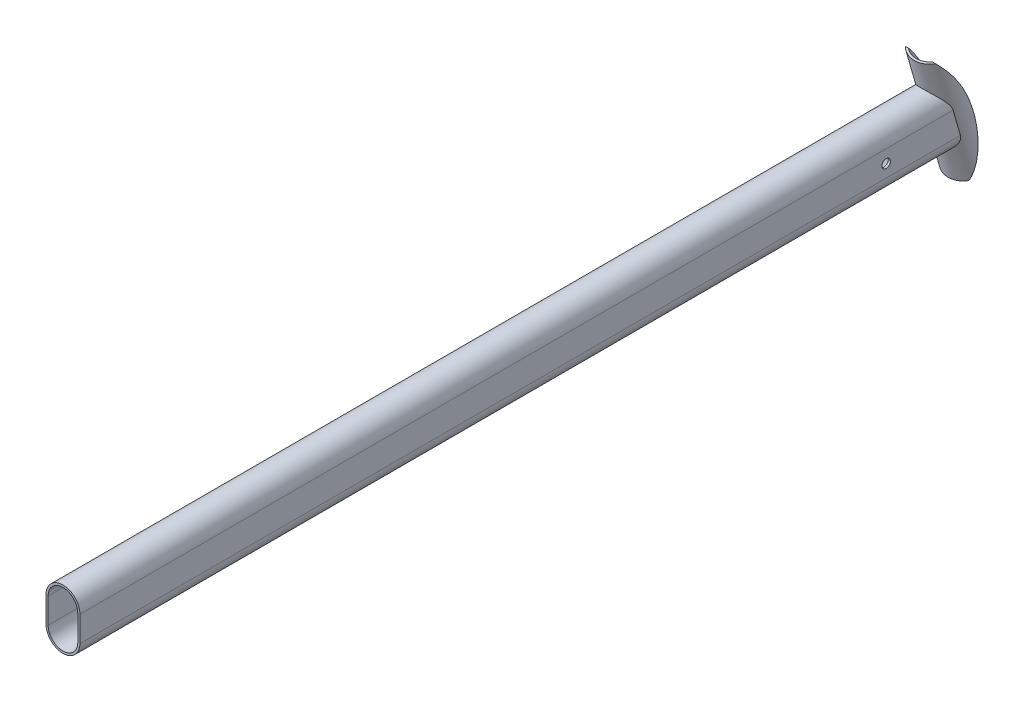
from build123d import *

# Parameters (mm, degrees)
EXTRU_MINCE1_DEPTH           = 1060
ENL_V_MAT_EXTRU_4_DEPTH      = 1069.247137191
EXTRU_MINCE2_DEPTH           = 115
EXTRU_MINCE2_DEPTH_BACK      = 30
ESQUISSE5_R                  = 25
ESQUISSE5_R_2                = 22.5
ENL_V_MAT_EXTRU_6_DEPTH      = 1066.419532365
ENL_V_MAT_EXTRU_6_DEPTH_BACK = 1066.419532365
ENL_V_MAT_EXTRU_7_DEPTH      = 1065.410861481
ENL_V_MAT_EXTRU_7_DEPTH_BACK = 1065.410861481
ESQUISSE7_R                  = 5


with BuildPart() as part:
    # Esquisse1 → Extru.-Mince1 (new body)
    with BuildSketch(Plane.XY):
        with BuildLine():
            Line((0, 0), (0, 30))
            ThreePointArc((0, 30), (20, 50), (40, 30))
            Line((40, 30), (40, 0))
            ThreePointArc((40, 0), (20, -20), (0, 0))
        make_face()
        with BuildLine():
            Line((2.5, 0), (2.5, 30))
            ThreePointArc((2.5, 30), (20, 47.5), (37.5, 30))
            Line((37.5, 30), (37.5, 0))
            ThreePointArc((37.5, 0), (20, -17.5), (2.5, 0))
        make_face(mode=Mode.SUBTRACT)
    extrude(amount=EXTRU_MINCE1_DEPTH)

    # Esquisse3 → Enl_v. mat.-Extru.4 (cut, through all)
    with BuildSketch(Plane(origin=(0, -18.480480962, -5.299192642), x_dir=(-1, 0, 0), z_dir=(0, 0.9612616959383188, 0.27563735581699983))):
        with BuildLine():
            Line((-42.5, 5.512747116), (-42.5, -16.987252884))
            Line((-42.5, -16.987252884), (2.5, -16.987252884))
            Line((2.5, -16.987252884), (2.5, 5.512747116))
            ThreePointArc((2.5, 5.512747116), (-20, 28.012747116), (-42.5, 5.512747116))
        make_face()
    extrude(amount=ENL_V_MAT_EXTRU_4_DEPTH, mode=Mode.SUBTRACT)

    # Esquisse7 → Enl_v. mat.-Extru.7 (cut, two sides: drawn at the far end of the back side and taken through both)
    with BuildSketch(Plane(origin=(0, 0, 0), x_dir=(0, 0, -1), z_dir=(1, 0, 0)).offset(-ENL_V_MAT_EXTRU_7_DEPTH_BACK)):
        with Locations((-108.864534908, 15)):
            Circle(ESQUISSE7_R)
    extrude(amount=ENL_V_MAT_EXTRU_7_DEPTH + ENL_V_MAT_EXTRU_7_DEPTH_BACK, mode=Mode.SUBTRACT)


with BuildPart() as body_2:
    # Esquisse5 → Extru.-Mince2 (new, two sides: drawn at the far end of the back side and taken through both)
    with BuildSketch(Plane(origin=(0, -18.480480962, -5.299192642), x_dir=(-1, 0, 0), z_dir=(0, 0.9612616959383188, 0.27563735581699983)).offset(-EXTRU_MINCE2_DEPTH_BACK)):
        with Locations((-20, 5.512747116)):
            Circle(ESQUISSE5_R)
        with Locations((-20, 5.512747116)):
            Circle(ESQUISSE5_R_2, mode=Mode.SUBTRACT)
    extrude(amount=EXTRU_MINCE2_DEPTH + EXTRU_MINCE2_DEPTH_BACK)

    # Esquisse6 → Enl_v. mat.-Extru.6 (cut, two sides: drawn at the far end of the back side and taken through both)
    with BuildSketch(Plane(origin=(0, 0, 0), x_dir=(0, 0, -1), z_dir=(1, 0, 0)).offset(-ENL_V_MAT_EXTRU_6_DEPTH_BACK)):
        with BuildLine():
            Line((-7.66675352, 97.436028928), (-48.574971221, 85.705786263))
            ThreePointArc((-48.574971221, 85.705786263), (-10.740493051, 21.09981332), (-8.845093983, -53.745272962))
            Line((-8.845093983, -53.745272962), (32.300663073, -41.946916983))
            Line((32.300663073, -41.946916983), (-7.66675352, 97.436028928))
        make_face()
    extrude(amount=ENL_V_MAT_EXTRU_6_DEPTH + ENL_V_MAT_EXTRU_6_DEPTH_BACK, mode=Mode.SUBTRACT)


solid = Compound([part.part, body_2.part])
